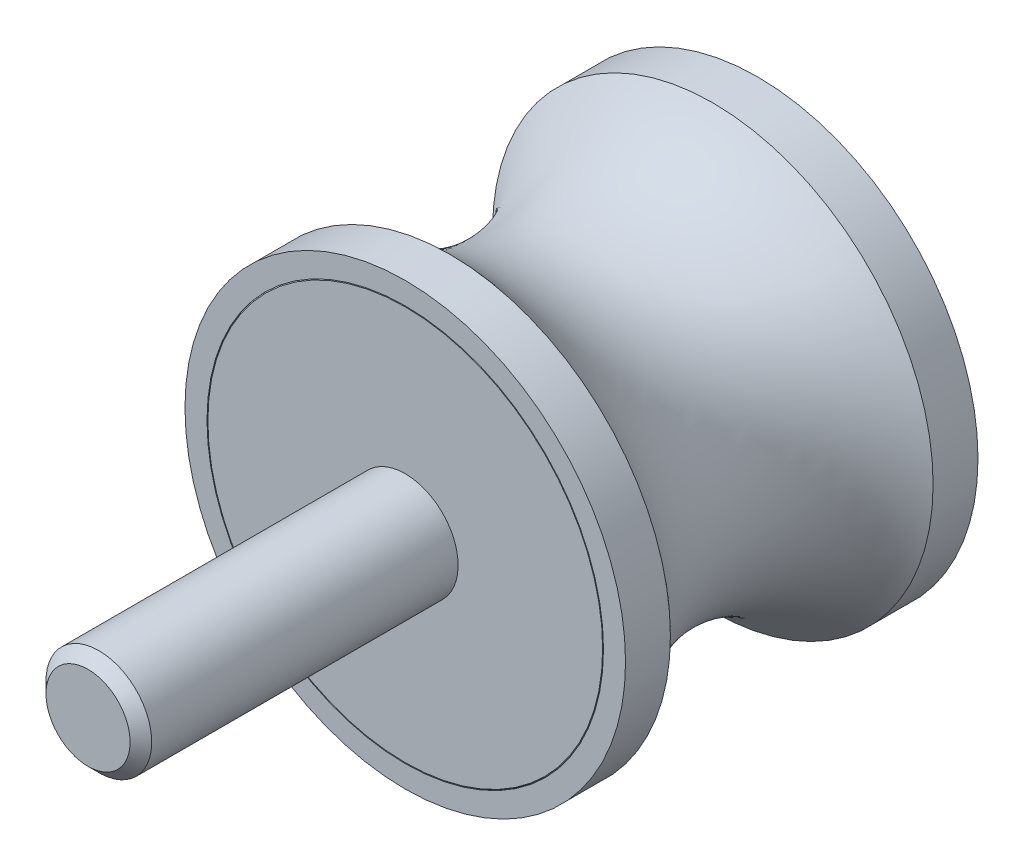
ISO-10303-21;
HEADER;
FILE_DESCRIPTION(('STEP AP214'),'2;1');
FILE_NAME('part.step','',(''),(''),'','','');
FILE_SCHEMA(('AUTOMOTIVE_DESIGN { 1 0 10303 214 1 1 1 1 }'));
ENDSEC;
DATA;
#1=APPLICATION_CONTEXT('core data for automotive mechanical design processes');
#2=APPLICATION_PROTOCOL_DEFINITION('international standard','automotive_design',2000,#1);
#3=PRODUCT_CONTEXT('',#1,'mechanical');
#4=PRODUCT('Part','Part','',(#3));
#5=PRODUCT_RELATED_PRODUCT_CATEGORY('part','',(#4));
#6=PRODUCT_DEFINITION_FORMATION('','',#4);
#7=PRODUCT_DEFINITION_CONTEXT('part definition',#1,'design');
#8=PRODUCT_DEFINITION('design','',#6,#7);
#9=PRODUCT_DEFINITION_SHAPE('','',#8);
#10=(LENGTH_UNIT() NAMED_UNIT(*) SI_UNIT(.MILLI.,.METRE.));
#11=(NAMED_UNIT(*) PLANE_ANGLE_UNIT() SI_UNIT($,.RADIAN.));
#12=(NAMED_UNIT(*) SI_UNIT($,.STERADIAN.) SOLID_ANGLE_UNIT());
#13=UNCERTAINTY_MEASURE_WITH_UNIT(LENGTH_MEASURE(1.E-05),#10,'distance_accuracy_value','');
#14=(GEOMETRIC_REPRESENTATION_CONTEXT(3) GLOBAL_UNCERTAINTY_ASSIGNED_CONTEXT((#13)) GLOBAL_UNIT_ASSIGNED_CONTEXT((#10,
#11,#12)) REPRESENTATION_CONTEXT('',''));
#15=CARTESIAN_POINT('',(0.,0.,0.));
#16=DIRECTION('',(0.,0.,1.));
#17=DIRECTION('',(1.,0.,0.));
#18=AXIS2_PLACEMENT_3D('',#15,#16,#17);
#19=CARTESIAN_POINT('',(0.,0.,0.5));
#20=DIRECTION('',(0.,0.,-1.));
#21=DIRECTION('',(0.,1.,0.));
#22=AXIS2_PLACEMENT_3D('',#19,#20,#21);
#23=CYLINDRICAL_SURFACE('',#22,11.25);
#24=CARTESIAN_POINT('',(0.,0.,0.05));
#25=DIRECTION('',(0.,0.,-1.));
#26=DIRECTION('',(0.,1.,0.));
#27=AXIS2_PLACEMENT_3D('',#24,#25,#26);
#28=CIRCLE('',#27,11.25);
#29=CARTESIAN_POINT('',(0.,11.25,0.05));
#30=VERTEX_POINT('',#29);
#31=EDGE_CURVE('E53',#30,#30,#28,.T.);
#32=ORIENTED_EDGE('',*,*,#31,.F.);
#33=EDGE_LOOP('',(#32));
#34=FACE_BOUND('',#33,.T.);
#35=CARTESIAN_POINT('',(0.,0.,0.));
#36=DIRECTION('',(0.,0.,-1.));
#37=DIRECTION('',(0.,1.,0.));
#38=AXIS2_PLACEMENT_3D('',#35,#36,#37);
#39=CIRCLE('',#38,11.25);
#40=CARTESIAN_POINT('',(0.,11.25,0.));
#41=VERTEX_POINT('',#40);
#42=EDGE_CURVE('E44',#41,#41,#39,.T.);
#43=ORIENTED_EDGE('',*,*,#42,.T.);
#44=EDGE_LOOP('',(#43));
#45=FACE_BOUND('',#44,.T.);
#46=ADVANCED_FACE('F12',(#34,#45),#23,.F.);
#47=CARTESIAN_POINT('',(0.,0.,0.5));
#48=DIRECTION('',(0.,0.,-1.));
#49=DIRECTION('',(0.,1.,0.));
#50=AXIS2_PLACEMENT_3D('',#47,#48,#49);
#51=CYLINDRICAL_SURFACE('',#50,11.25);
#52=CARTESIAN_POINT('',(0.,0.,20.));
#53=DIRECTION('',(0.,0.,-1.));
#54=DIRECTION('',(0.,1.,0.));
#55=AXIS2_PLACEMENT_3D('',#52,#53,#54);
#56=CIRCLE('',#55,11.25);
#57=CARTESIAN_POINT('',(0.,11.25,20.));
#58=VERTEX_POINT('',#57);
#59=EDGE_CURVE('E27',#58,#58,#56,.T.);
#60=ORIENTED_EDGE('',*,*,#59,.F.);
#61=EDGE_LOOP('',(#60));
#62=FACE_BOUND('',#61,.T.);
#63=CARTESIAN_POINT('',(0.,0.,19.95));
#64=DIRECTION('',(0.,0.,-1.));
#65=DIRECTION('',(0.,1.,0.));
#66=AXIS2_PLACEMENT_3D('',#63,#64,#65);
#67=CIRCLE('',#66,11.25);
#68=CARTESIAN_POINT('',(0.,11.25,19.95));
#69=VERTEX_POINT('',#68);
#70=EDGE_CURVE('E50',#69,#69,#67,.T.);
#71=ORIENTED_EDGE('',*,*,#70,.T.);
#72=EDGE_LOOP('',(#71));
#73=FACE_BOUND('',#72,.T.);
#74=ADVANCED_FACE('F89',(#62,#73),#51,.F.);
#75=CARTESIAN_POINT('',(11.25,0.,20.));
#76=DIRECTION('',(0.,0.,-1.));
#77=DIRECTION('',(0.,1.,0.));
#78=AXIS2_PLACEMENT_3D('',#75,#76,#77);
#79=PLANE('',#78);
#80=CARTESIAN_POINT('',(0.,0.,20.));
#81=DIRECTION('',(0.,0.,-1.));
#82=DIRECTION('',(0.,1.,0.));
#83=AXIS2_PLACEMENT_3D('',#80,#81,#82);
#84=CIRCLE('',#83,12.5);
#85=CARTESIAN_POINT('',(0.,12.5,20.));
#86=VERTEX_POINT('',#85);
#87=EDGE_CURVE('E32',#86,#86,#84,.T.);
#88=ORIENTED_EDGE('',*,*,#87,.F.);
#89=EDGE_LOOP('',(#88));
#90=FACE_BOUND('',#89,.T.);
#91=ORIENTED_EDGE('',*,*,#59,.T.);
#92=EDGE_LOOP('',(#91));
#93=FACE_BOUND('',#92,.T.);
#94=ADVANCED_FACE('F115',(#90,#93),#79,.F.);
#95=CARTESIAN_POINT('',(0.,0.,0.5));
#96=DIRECTION('',(0.,0.,-1.));
#97=DIRECTION('',(0.,1.,0.));
#98=AXIS2_PLACEMENT_3D('',#95,#96,#97);
#99=CYLINDRICAL_SURFACE('',#98,12.5);
#100=CARTESIAN_POINT('',(0.,0.,17.4535599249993));
#101=DIRECTION('',(0.,0.,-1.));
#102=DIRECTION('',(0.,1.,0.));
#103=AXIS2_PLACEMENT_3D('',#100,#101,#102);
#104=CIRCLE('',#103,12.5);
#105=CARTESIAN_POINT('',(0.,12.5,17.4535599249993));
#106=VERTEX_POINT('',#105);
#107=EDGE_CURVE('E35',#106,#106,#104,.T.);
#108=ORIENTED_EDGE('',*,*,#107,.F.);
#109=EDGE_LOOP('',(#108));
#110=FACE_BOUND('',#109,.T.);
#111=ORIENTED_EDGE('',*,*,#87,.T.);
#112=EDGE_LOOP('',(#111));
#113=FACE_BOUND('',#112,.T.);
#114=ADVANCED_FACE('F109',(#110,#113),#99,.T.);
#115=CARTESIAN_POINT('',(0.,0.,10.));
#116=DIRECTION('',(0.,0.,-1.));
#117=DIRECTION('',(0.,1.,0.));
#118=AXIS2_PLACEMENT_3D('',#115,#116,#117);
#119=TOROIDAL_SURFACE('',#118,18.6865079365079,9.68650793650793);
#120=CARTESIAN_POINT('',(0.,0.,2.5464400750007));
#121=DIRECTION('',(0.,0.,-1.));
#122=DIRECTION('',(0.,1.,0.));
#123=AXIS2_PLACEMENT_3D('',#120,#121,#122);
#124=CIRCLE('',#123,12.5);
#125=CARTESIAN_POINT('',(0.,12.5,2.5464400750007));
#126=VERTEX_POINT('',#125);
#127=EDGE_CURVE('E38',#126,#126,#124,.T.);
#128=ORIENTED_EDGE('',*,*,#127,.F.);
#129=EDGE_LOOP('',(#128));
#130=FACE_BOUND('',#129,.T.);
#131=ORIENTED_EDGE('',*,*,#107,.T.);
#132=EDGE_LOOP('',(#131));
#133=FACE_BOUND('',#132,.T.);
#134=ADVANCED_FACE('F103',(#130,#133),#119,.F.);
#135=CARTESIAN_POINT('',(0.,0.,0.5));
#136=DIRECTION('',(0.,0.,-1.));
#137=DIRECTION('',(0.,1.,0.));
#138=AXIS2_PLACEMENT_3D('',#135,#136,#137);
#139=CYLINDRICAL_SURFACE('',#138,12.5);
#140=CARTESIAN_POINT('',(0.,0.,0.));
#141=DIRECTION('',(0.,0.,-1.));
#142=DIRECTION('',(0.,1.,0.));
#143=AXIS2_PLACEMENT_3D('',#140,#141,#142);
#144=CIRCLE('',#143,12.5);
#145=CARTESIAN_POINT('',(0.,12.5,0.));
#146=VERTEX_POINT('',#145);
#147=EDGE_CURVE('E41',#146,#146,#144,.T.);
#148=ORIENTED_EDGE('',*,*,#147,.F.);
#149=EDGE_LOOP('',(#148));
#150=FACE_BOUND('',#149,.T.);
#151=ORIENTED_EDGE('',*,*,#127,.T.);
#152=EDGE_LOOP('',(#151));
#153=FACE_BOUND('',#152,.T.);
#154=ADVANCED_FACE('F97',(#150,#153),#139,.T.);
#155=CARTESIAN_POINT('',(12.5,0.,0.));
#156=DIRECTION('',(0.,0.,1.));
#157=DIRECTION('',(0.,-1.,0.));
#158=AXIS2_PLACEMENT_3D('',#155,#156,#157);
#159=PLANE('',#158);
#160=ORIENTED_EDGE('',*,*,#42,.F.);
#161=EDGE_LOOP('',(#160));
#162=FACE_BOUND('',#161,.T.);
#163=ORIENTED_EDGE('',*,*,#147,.T.);
#164=EDGE_LOOP('',(#163));
#165=FACE_BOUND('',#164,.T.);
#166=ADVANCED_FACE('F93',(#162,#165),#159,.F.);
#167=CARTESIAN_POINT('',(0.,0.,20.));
#168=DIRECTION('',(0.,0.,-1.));
#169=DIRECTION('',(0.,1.,0.));
#170=AXIS2_PLACEMENT_3D('',#167,#168,#169);
#171=PLANE('',#170);
#172=CARTESIAN_POINT('',(0.,0.,20.));
#173=DIRECTION('',(0.,0.,-1.));
#174=DIRECTION('',(0.,1.,0.));
#175=AXIS2_PLACEMENT_3D('',#172,#173,#174);
#176=CIRCLE('',#175,11.2);
#177=CARTESIAN_POINT('',(0.,11.2,20.));
#178=VERTEX_POINT('',#177);
#179=EDGE_CURVE('E47',#178,#178,#176,.T.);
#180=ORIENTED_EDGE('',*,*,#179,.F.);
#181=EDGE_LOOP('',(#180));
#182=FACE_BOUND('',#181,.T.);
#183=CARTESIAN_POINT('',(0.,0.,20.));
#184=DIRECTION('',(0.,0.,-1.));
#185=DIRECTION('',(0.,1.,0.));
#186=AXIS2_PLACEMENT_3D('',#183,#184,#185);
#187=CIRCLE('',#186,3.);
#188=CARTESIAN_POINT('',(0.,3.,20.));
#189=VERTEX_POINT('',#188);
#190=EDGE_CURVE('E8',#189,#189,#187,.T.);
#191=ORIENTED_EDGE('',*,*,#190,.T.);
#192=EDGE_LOOP('',(#191));
#193=FACE_BOUND('',#192,.T.);
#194=ADVANCED_FACE('F96',(#182,#193),#171,.F.);
#195=CARTESIAN_POINT('',(0.,0.,20.));
#196=DIRECTION('',(0.,0.,-1.));
#197=DIRECTION('',(0.,1.,0.));
#198=AXIS2_PLACEMENT_3D('',#195,#196,#197);
#199=CONICAL_SURFACE('',#198,11.2,0.785398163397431);
#200=ORIENTED_EDGE('',*,*,#70,.F.);
#201=EDGE_LOOP('',(#200));
#202=FACE_BOUND('',#201,.T.);
#203=ORIENTED_EDGE('',*,*,#179,.T.);
#204=EDGE_LOOP('',(#203));
#205=FACE_BOUND('',#204,.T.);
#206=ADVANCED_FACE('F129',(#202,#205),#199,.T.);
#207=CARTESIAN_POINT('',(0.,0.,38.));
#208=DIRECTION('',(0.,0.,-1.));
#209=DIRECTION('',(0.,1.,0.));
#210=AXIS2_PLACEMENT_3D('',#207,#208,#209);
#211=PLANE('',#210);
#212=CARTESIAN_POINT('',(0.,0.,38.));
#213=DIRECTION('',(0.,0.,-1.));
#214=DIRECTION('',(0.,1.,0.));
#215=AXIS2_PLACEMENT_3D('',#212,#213,#214);
#216=CIRCLE('',#215,2.3865);
#217=CARTESIAN_POINT('',(0.,2.3865,38.));
#218=VERTEX_POINT('',#217);
#219=EDGE_CURVE('E19',#218,#218,#216,.T.);
#220=ORIENTED_EDGE('',*,*,#219,.F.);
#221=EDGE_LOOP('',(#220));
#222=FACE_BOUND('',#221,.T.);
#223=ADVANCED_FACE('F14',(#222),#211,.F.);
#224=CARTESIAN_POINT('',(0.,0.,38.));
#225=DIRECTION('',(0.,0.,-1.));
#226=DIRECTION('',(0.,1.,0.));
#227=AXIS2_PLACEMENT_3D('',#224,#225,#226);
#228=CONICAL_SURFACE('',#227,2.3865,0.785398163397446);
#229=CARTESIAN_POINT('',(0.,0.,37.3865));
#230=DIRECTION('',(0.,0.,-1.));
#231=DIRECTION('',(0.,1.,0.));
#232=AXIS2_PLACEMENT_3D('',#229,#230,#231);
#233=CIRCLE('',#232,3.);
#234=CARTESIAN_POINT('',(0.,3.,37.3865));
#235=VERTEX_POINT('',#234);
#236=EDGE_CURVE('E23',#235,#235,#233,.T.);
#237=ORIENTED_EDGE('',*,*,#236,.F.);
#238=EDGE_LOOP('',(#237));
#239=FACE_BOUND('',#238,.T.);
#240=ORIENTED_EDGE('',*,*,#219,.T.);
#241=EDGE_LOOP('',(#240));
#242=FACE_BOUND('',#241,.T.);
#243=ADVANCED_FACE('F142',(#239,#242),#228,.T.);
#244=CARTESIAN_POINT('',(0.,0.,0.5));
#245=DIRECTION('',(0.,0.,-1.));
#246=DIRECTION('',(0.,1.,0.));
#247=AXIS2_PLACEMENT_3D('',#244,#245,#246);
#248=CYLINDRICAL_SURFACE('',#247,3.);
#249=ORIENTED_EDGE('',*,*,#190,.F.);
#250=EDGE_LOOP('',(#249));
#251=FACE_BOUND('',#250,.T.);
#252=ORIENTED_EDGE('',*,*,#236,.T.);
#253=EDGE_LOOP('',(#252));
#254=FACE_BOUND('',#253,.T.);
#255=ADVANCED_FACE('F83',(#251,#254),#248,.T.);
#256=CARTESIAN_POINT('',(0.,0.,0.05));
#257=DIRECTION('',(0.,0.,1.));
#258=DIRECTION('',(0.,-1.,0.));
#259=AXIS2_PLACEMENT_3D('',#256,#257,#258);
#260=CONICAL_SURFACE('',#259,11.25,0.785398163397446);
#261=CARTESIAN_POINT('',(0.,0.,0.));
#262=DIRECTION('',(0.,0.,-1.));
#263=DIRECTION('',(0.,1.,0.));
#264=AXIS2_PLACEMENT_3D('',#261,#262,#263);
#265=CIRCLE('',#264,11.2);
#266=CARTESIAN_POINT('',(0.,11.2,0.));
#267=VERTEX_POINT('',#266);
#268=EDGE_CURVE('E56',#267,#267,#265,.T.);
#269=ORIENTED_EDGE('',*,*,#268,.F.);
#270=EDGE_LOOP('',(#269));
#271=FACE_BOUND('',#270,.T.);
#272=ORIENTED_EDGE('',*,*,#31,.T.);
#273=EDGE_LOOP('',(#272));
#274=FACE_BOUND('',#273,.T.);
#275=ADVANCED_FACE('F77',(#271,#274),#260,.T.);
#276=CARTESIAN_POINT('',(11.2,0.,0.));
#277=DIRECTION('',(0.,0.,1.));
#278=DIRECTION('',(0.,-1.,0.));
#279=AXIS2_PLACEMENT_3D('',#276,#277,#278);
#280=PLANE('',#279);
#281=CARTESIAN_POINT('',(0.,0.,0.));
#282=DIRECTION('',(0.,0.,-1.));
#283=DIRECTION('',(0.,1.,0.));
#284=AXIS2_PLACEMENT_3D('',#281,#282,#283);
#285=CIRCLE('',#284,3.);
#286=CARTESIAN_POINT('',(0.,3.,0.));
#287=VERTEX_POINT('',#286);
#288=EDGE_CURVE('E60',#287,#287,#285,.T.);
#289=ORIENTED_EDGE('',*,*,#288,.F.);
#290=EDGE_LOOP('',(#289));
#291=FACE_BOUND('',#290,.T.);
#292=ORIENTED_EDGE('',*,*,#268,.T.);
#293=EDGE_LOOP('',(#292));
#294=FACE_BOUND('',#293,.T.);
#295=ADVANCED_FACE('F71',(#291,#294),#280,.F.);
#296=CARTESIAN_POINT('',(0.,0.,6.));
#297=DIRECTION('',(0.,0.,-1.));
#298=DIRECTION('',(0.,1.,0.));
#299=AXIS2_PLACEMENT_3D('',#296,#297,#298);
#300=CYLINDRICAL_SURFACE('',#299,3.);
#301=CARTESIAN_POINT('',(0.,0.,6.));
#302=DIRECTION('',(0.,0.,-1.));
#303=DIRECTION('',(0.,1.,0.));
#304=AXIS2_PLACEMENT_3D('',#301,#302,#303);
#305=CIRCLE('',#304,3.);
#306=CARTESIAN_POINT('',(0.,3.,6.));
#307=VERTEX_POINT('',#306);
#308=EDGE_CURVE('E59',#307,#307,#305,.T.);
#309=ORIENTED_EDGE('',*,*,#308,.F.);
#310=EDGE_LOOP('',(#309));
#311=FACE_BOUND('',#310,.T.);
#312=ORIENTED_EDGE('',*,*,#288,.T.);
#313=EDGE_LOOP('',(#312));
#314=FACE_BOUND('',#313,.T.);
#315=ADVANCED_FACE('F68',(#311,#314),#300,.F.);
#316=CARTESIAN_POINT('',(0.,0.,6.));
#317=DIRECTION('',(0.,0.,-1.));
#318=DIRECTION('',(0.,1.,0.));
#319=AXIS2_PLACEMENT_3D('',#316,#317,#318);
#320=PLANE('',#319);
#321=ORIENTED_EDGE('',*,*,#308,.T.);
#322=EDGE_LOOP('',(#321));
#323=FACE_BOUND('',#322,.T.);
#324=ADVANCED_FACE('F66',(#323),#320,.T.);
#325=CLOSED_SHELL('',(#46,#74,#94,#114,#134,#154,#166,#194,#206,#223,#243,#255,#275,#295,#315,#324));
#326=MANIFOLD_SOLID_BREP('B1',#325);
#327=ADVANCED_BREP_SHAPE_REPRESENTATION('',(#18,#326),#14);
#328=SHAPE_DEFINITION_REPRESENTATION(#9,#327);
ENDSEC;
END-ISO-10303-21;
